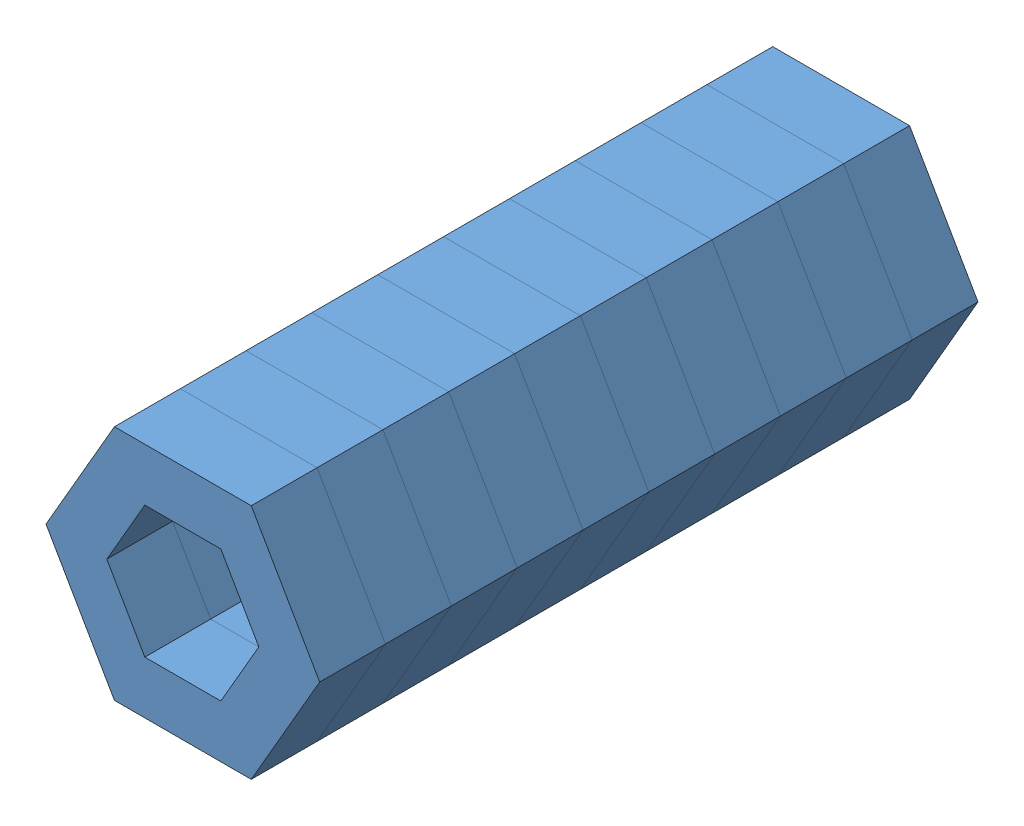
SolidWorks assembly Spacer-stack-10.SLDASM, configuration Default (file format 7000). Lengths in mm.
Overall size (13.2 11.43 31.75).
10 component instances, 1 part files, 18 mates.
Components (placement in the parent):
- Spacer-hex-1s4-1: Spacer-hex-1s4.SLDPRT [Default] at (7.8847 8.4687 7.4956) size (13.2 11.43 3.17)
- Spacer-hex-1s4-2: Spacer-hex-1s4.SLDPRT [Default] at (7.8847 8.4687 10.6706) size (13.2 11.43 3.17)
- Spacer-hex-1s4-3: Spacer-hex-1s4.SLDPRT [Default] at (7.8847 8.4687 13.8456) size (13.2 11.43 3.17)
- Spacer-hex-1s4-4: Spacer-hex-1s4.SLDPRT [Default] at (7.8847 8.4687 17.0206) size (13.2 11.43 3.17)
- Spacer-hex-1s4-5: Spacer-hex-1s4.SLDPRT [Default] at (7.8847 8.4687 20.1956) size (13.2 11.43 3.17)
- Spacer-hex-1s4-6: Spacer-hex-1s4.SLDPRT [Default] at (7.8847 8.4687 23.3706) size (13.2 11.43 3.17)
- Spacer-hex-1s4-7: Spacer-hex-1s4.SLDPRT [Default] at (7.8847 8.4687 26.5456) size (13.2 11.43 3.17)
- Spacer-hex-1s4-8: Spacer-hex-1s4.SLDPRT [Default] at (7.8847 8.4687 29.7206) size (13.2 11.43 3.17)
- Spacer-hex-1s4-9: Spacer-hex-1s4.SLDPRT [Default] at (7.8847 8.4687 32.8956) size (13.2 11.43 3.17)
- Spacer-hex-1s4-10: Spacer-hex-1s4.SLDPRT [Default] at (7.8847 8.4687 36.0706) size (13.2 11.43 3.17)
Mates (geometry in assembly coordinates):
- Coincident3: coincident aligned: line of Spacer-hex-1s4-1 through (9.7178 11.6437 10.6706) axis (-1 0 0); line of Spacer-hex-1s4-2 through (9.7178 11.6437 10.6706) axis (-1 0 0)
- Coincident4: coincident aligned: line of Spacer-hex-1s4-1 through (11.5509 8.4687 10.6706) axis (-0.5 0.866025 0); line of Spacer-hex-1s4-2 through (11.5509 8.4687 10.6706) axis (-0.5 0.866025 0)
- Coincident5: coincident aligned: line of Spacer-hex-1s4-2 through (9.7178 11.6437 13.8456) axis (-1 0 0); line of Spacer-hex-1s4-3 through (9.7178 11.6437 13.8456) axis (-1 0 0)
- Coincident6: coincident aligned: line of Spacer-hex-1s4-2 through (11.5509 8.4687 13.8456) axis (-0.5 0.866025 0); line of Spacer-hex-1s4-3 through (11.5509 8.4687 13.8456) axis (-0.5 0.866025 0)
- Coincident9: coincident aligned: line of Spacer-hex-1s4-3 through (11.5509 8.4687 17.0206) axis (-0.5 0.866025 0); line of Spacer-hex-1s4-4 through (11.5509 8.4687 17.0206) axis (-0.5 0.866025 0)
- Coincident10: coincident aligned: line of Spacer-hex-1s4-3 through (9.7178 11.6437 17.0206) axis (-1 0 0); line of Spacer-hex-1s4-4 through (9.7178 11.6437 17.0206) axis (-1 0 0)
- Coincident11: coincident aligned: line of Spacer-hex-1s4-4 through (9.7178 11.6437 20.1956) axis (-1 0 0); line of Spacer-hex-1s4-5 through (9.7178 11.6437 20.1956) axis (-1 0 0)
- Coincident12: coincident aligned: line of Spacer-hex-1s4-4 through (11.5509 8.4687 20.1956) axis (-0.5 0.866025 0); line of Spacer-hex-1s4-5 through (11.5509 8.4687 20.1956) axis (-0.5 0.866025 0)
- Coincident13: coincident aligned: line of Spacer-hex-1s4-5 through (9.7178 11.6437 23.3706) axis (-1 0 0); line of Spacer-hex-1s4-6 through (9.7178 11.6437 23.3706) axis (-1 0 0)
- Coincident14: coincident aligned: line of Spacer-hex-1s4-5 through (11.5509 8.4687 23.3706) axis (-0.5 0.866025 0); line of Spacer-hex-1s4-6 through (11.5509 8.4687 23.3706) axis (-0.5 0.866025 0)
- Coincident15: coincident aligned: line of Spacer-hex-1s4-6 through (9.7178 11.6437 26.5456) axis (-1 0 0); line of Spacer-hex-1s4-7 through (9.7178 11.6437 26.5456) axis (-1 0 0)
- Coincident16: coincident aligned: line of Spacer-hex-1s4-6 through (11.5509 8.4687 26.5456) axis (-0.5 0.866025 0); line of Spacer-hex-1s4-7 through (11.5509 8.4687 26.5456) axis (-0.5 0.866025 0)
- Coincident17: coincident aligned: line of Spacer-hex-1s4-7 through (9.7178 11.6437 29.7206) axis (-1 0 0); line of Spacer-hex-1s4-8 through (9.7178 11.6437 29.7206) axis (-1 0 0)
- Coincident18: coincident aligned: line of Spacer-hex-1s4-7 through (11.5509 8.4687 29.7206) axis (-0.5 0.866025 0); line of Spacer-hex-1s4-8 through (11.5509 8.4687 29.7206) axis (-0.5 0.866025 0)
- Coincident19: coincident aligned: line of Spacer-hex-1s4-8 through (9.7178 11.6437 32.8956) axis (-1 0 0); line of Spacer-hex-1s4-9 through (9.7178 11.6437 32.8956) axis (-1 0 0)
- Coincident20: coincident aligned: line of Spacer-hex-1s4-8 through (11.5509 8.4687 32.8956) axis (-0.5 0.866025 0); line of Spacer-hex-1s4-9 through (11.5509 8.4687 32.8956) axis (-0.5 0.866025 0)
- Coincident21: coincident: line of Spacer-hex-1s4-9 through (9.7178 11.6437 36.0706) axis (-1 0 0); line of Spacer-hex-1s4-10 through (9.7178 11.6437 36.0706) axis (-1 0 0)
- Coincident22: coincident aligned: line of Spacer-hex-1s4-9 through (11.5509 8.4687 36.0706) axis (-0.5 0.866025 0); line of Spacer-hex-1s4-10 through (11.5509 8.4687 36.0706) axis (-0.5 0.866025 0)
